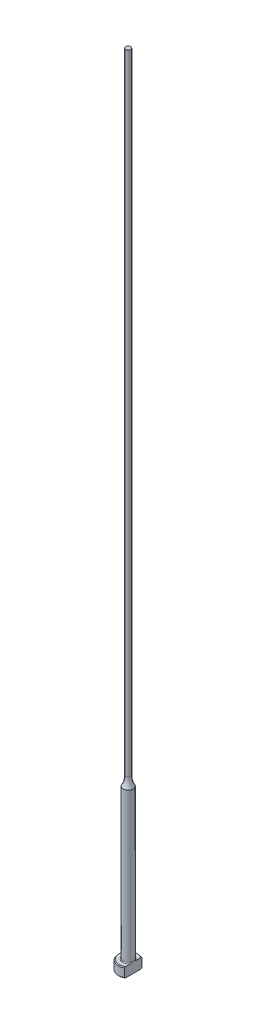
ISO-10303-21;
HEADER;
FILE_DESCRIPTION(('STEP AP214'),'2;1');
FILE_NAME('part.step','',(''),(''),'','','');
FILE_SCHEMA(('AUTOMOTIVE_DESIGN { 1 0 10303 214 1 1 1 1 }'));
ENDSEC;
DATA;
#1=APPLICATION_CONTEXT('core data for automotive mechanical design processes');
#2=APPLICATION_PROTOCOL_DEFINITION('international standard','automotive_design',2000,#1);
#3=PRODUCT_CONTEXT('',#1,'mechanical');
#4=PRODUCT('Part','Part','',(#3));
#5=PRODUCT_RELATED_PRODUCT_CATEGORY('part','',(#4));
#6=PRODUCT_DEFINITION_FORMATION('','',#4);
#7=PRODUCT_DEFINITION_CONTEXT('part definition',#1,'design');
#8=PRODUCT_DEFINITION('design','',#6,#7);
#9=PRODUCT_DEFINITION_SHAPE('','',#8);
#10=(LENGTH_UNIT() NAMED_UNIT(*) SI_UNIT(.MILLI.,.METRE.));
#11=(NAMED_UNIT(*) PLANE_ANGLE_UNIT() SI_UNIT($,.RADIAN.));
#12=(NAMED_UNIT(*) SI_UNIT($,.STERADIAN.) SOLID_ANGLE_UNIT());
#13=UNCERTAINTY_MEASURE_WITH_UNIT(LENGTH_MEASURE(1.E-05),#10,'distance_accuracy_value','');
#14=(GEOMETRIC_REPRESENTATION_CONTEXT(3) GLOBAL_UNCERTAINTY_ASSIGNED_CONTEXT((#13)) GLOBAL_UNIT_ASSIGNED_CONTEXT((#10,
#11,#12)) REPRESENTATION_CONTEXT('',''));
#15=CARTESIAN_POINT('',(0.,0.,0.));
#16=DIRECTION('',(0.,0.,1.));
#17=DIRECTION('',(1.,0.,0.));
#18=AXIS2_PLACEMENT_3D('',#15,#16,#17);
#19=CARTESIAN_POINT('',(-3.17499999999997,3.175,0.));
#20=DIRECTION('',(0.,1.,0.));
#21=DIRECTION('',(0.,0.,1.));
#22=AXIS2_PLACEMENT_3D('',#19,#20,#21);
#23=PLANE('',#22);
#24=CARTESIAN_POINT('',(0.,3.175,0.));
#25=DIRECTION('',(0.,1.,0.));
#26=DIRECTION('',(0.,0.,1.));
#27=AXIS2_PLACEMENT_3D('',#24,#25,#26);
#28=CIRCLE('',#27,2.92099999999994);
#29=CARTESIAN_POINT('',(1.58749999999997,3.175,-2.45195529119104));
#30=VERTEX_POINT('',#29);
#31=CARTESIAN_POINT('',(1.58749999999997,3.175,2.45195529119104));
#32=VERTEX_POINT('',#31);
#33=EDGE_CURVE('E105',#30,#32,#28,.T.);
#34=ORIENTED_EDGE('',*,*,#33,.T.);
#35=DIRECTION('',(0.,0.,1.));
#36=VECTOR('',#35,1.);
#37=CARTESIAN_POINT('',(1.58749999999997,3.17499999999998,2.74963065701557));
#38=LINE('',#37,#36);
#39=CARTESIAN_POINT('',(1.58749999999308,3.175,0.933255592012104));
#40=VERTEX_POINT('',#39);
#41=EDGE_CURVE('E126',#40,#32,#38,.T.);
#42=ORIENTED_EDGE('',*,*,#41,.F.);
#43=CARTESIAN_POINT('',(0.,3.175,0.));
#44=DIRECTION('',(0.,1.,0.));
#45=DIRECTION('',(0.,0.,1.));
#46=AXIS2_PLACEMENT_3D('',#43,#44,#45);
#47=CIRCLE('',#46,1.84149999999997);
#48=CARTESIAN_POINT('',(1.58749999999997,3.17500000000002,-0.933255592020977));
#49=VERTEX_POINT('',#48);
#50=EDGE_CURVE('E11',#40,#49,#47,.F.);
#51=ORIENTED_EDGE('',*,*,#50,.T.);
#52=EDGE_CURVE('E52',#30,#49,#38,.T.);
#53=ORIENTED_EDGE('',*,*,#52,.F.);
#54=EDGE_LOOP('',(#34,#42,#51,#53));
#55=FACE_BOUND('',#54,.T.);
#56=ADVANCED_FACE('F32',(#55),#23,.T.);
#57=CARTESIAN_POINT('',(0.,259.958771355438,0.));
#58=DIRECTION('',(0.,1.,0.));
#59=DIRECTION('',(0.,0.,1.));
#60=AXIS2_PLACEMENT_3D('',#57,#58,#59);
#61=CYLINDRICAL_SURFACE('',#60,3.17499999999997);
#62=CARTESIAN_POINT('',(0.,2.92100000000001,0.));
#63=DIRECTION('',(0.,1.,0.));
#64=DIRECTION('',(0.,0.,1.));
#65=AXIS2_PLACEMENT_3D('',#62,#63,#64);
#66=CIRCLE('',#65,3.17499999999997);
#67=CARTESIAN_POINT('',(1.58749999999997,2.92100000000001,2.74963065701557));
#68=VERTEX_POINT('',#67);
#69=CARTESIAN_POINT('',(1.58749999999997,2.92100000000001,-2.74963065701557));
#70=VERTEX_POINT('',#69);
#71=EDGE_CURVE('E98',#68,#70,#66,.F.);
#72=ORIENTED_EDGE('',*,*,#71,.T.);
#73=DIRECTION('',(0.,-1.,0.));
#74=VECTOR('',#73,1.);
#75=CARTESIAN_POINT('',(1.58749999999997,254.001,-2.74963065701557));
#76=LINE('',#75,#74);
#77=CARTESIAN_POINT('',(1.58749999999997,0.253999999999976,-2.74963065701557));
#78=VERTEX_POINT('',#77);
#79=EDGE_CURVE('E141',#70,#78,#76,.T.);
#80=ORIENTED_EDGE('',*,*,#79,.T.);
#81=CARTESIAN_POINT('',(0.,0.253999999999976,0.));
#82=DIRECTION('',(0.,-1.,0.));
#83=DIRECTION('',(0.,0.,-1.));
#84=AXIS2_PLACEMENT_3D('',#81,#82,#83);
#85=CIRCLE('',#84,3.17499999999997);
#86=CARTESIAN_POINT('',(1.58749999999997,0.253999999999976,2.74963065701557));
#87=VERTEX_POINT('',#86);
#88=EDGE_CURVE('E95',#78,#87,#85,.F.);
#89=ORIENTED_EDGE('',*,*,#88,.T.);
#90=DIRECTION('',(0.,-1.,0.));
#91=VECTOR('',#90,1.);
#92=CARTESIAN_POINT('',(1.58749999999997,254.001,2.74963065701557));
#93=LINE('',#92,#91);
#94=EDGE_CURVE('E88',#68,#87,#93,.T.);
#95=ORIENTED_EDGE('',*,*,#94,.F.);
#96=EDGE_LOOP('',(#72,#80,#89,#95));
#97=FACE_BOUND('',#96,.T.);
#98=ADVANCED_FACE('F191',(#97),#61,.T.);
#99=CARTESIAN_POINT('',(0.,0.,0.));
#100=DIRECTION('',(0.,-1.,0.));
#101=DIRECTION('',(0.,0.,-1.));
#102=AXIS2_PLACEMENT_3D('',#99,#100,#101);
#103=PLANE('',#102);
#104=CARTESIAN_POINT('',(0.,0.,0.));
#105=DIRECTION('',(0.,-1.,0.));
#106=DIRECTION('',(0.,0.,-1.));
#107=AXIS2_PLACEMENT_3D('',#104,#105,#106);
#108=CIRCLE('',#107,2.92100000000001);
#109=CARTESIAN_POINT('',(1.58749999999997,0.,2.45195529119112));
#110=VERTEX_POINT('',#109);
#111=CARTESIAN_POINT('',(1.58749999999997,0.,-2.45195529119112));
#112=VERTEX_POINT('',#111);
#113=EDGE_CURVE('E93',#110,#112,#108,.T.);
#114=ORIENTED_EDGE('',*,*,#113,.T.);
#115=DIRECTION('',(0.,0.,1.));
#116=VECTOR('',#115,1.);
#117=CARTESIAN_POINT('',(1.58749999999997,0.,2.74963065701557));
#118=LINE('',#117,#116);
#119=EDGE_CURVE('E78',#112,#110,#118,.T.);
#120=ORIENTED_EDGE('',*,*,#119,.T.);
#121=EDGE_LOOP('',(#114,#120));
#122=FACE_BOUND('',#121,.T.);
#123=ADVANCED_FACE('F97',(#122),#103,.T.);
#124=CARTESIAN_POINT('',(0.,3.17499999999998,0.));
#125=DIRECTION('',(0.,-1.,0.));
#126=DIRECTION('',(0.,0.,-1.));
#127=AXIS2_PLACEMENT_3D('',#124,#125,#126);
#128=CONICAL_SURFACE('',#127,2.92099999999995,0.785398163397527);
#129=ORIENTED_EDGE('',*,*,#71,.F.);
#130=CARTESIAN_POINT('',(1.58749999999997,-0.16162066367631,-6.0529050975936));
#131=CARTESIAN_POINT('',(1.58749999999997,-0.0288893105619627,-5.91567682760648));
#132=CARTESIAN_POINT('',(1.58749999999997,0.103699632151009,-5.7783103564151));
#133=CARTESIAN_POINT('',(1.58749999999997,0.368508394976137,-5.50321874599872));
#134=CARTESIAN_POINT('',(1.58749999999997,0.500728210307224,-5.36549360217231));
#135=CARTESIAN_POINT('',(1.58749999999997,0.764778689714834,-5.08953516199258));
#136=CARTESIAN_POINT('',(1.58749999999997,0.896609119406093,-4.9513016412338));
#137=CARTESIAN_POINT('',(1.58749999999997,1.15968706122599,-4.67428233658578));
#138=CARTESIAN_POINT('',(1.58749999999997,1.29093457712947,-4.53549655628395));
#139=CARTESIAN_POINT('',(1.58749999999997,1.55007705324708,-4.25997724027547));
#140=CARTESIAN_POINT('',(1.58749999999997,1.67798684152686,-4.12325766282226));
#141=CARTESIAN_POINT('',(1.58749999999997,1.9328486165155,-3.84892898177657));
#142=CARTESIAN_POINT('',(1.58749999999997,2.05980060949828,-3.71131988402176));
#143=CARTESIAN_POINT('',(1.58749999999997,2.31237508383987,-3.43493978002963));
#144=CARTESIAN_POINT('',(1.58749999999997,2.43799784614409,-3.29616903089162));
#145=CARTESIAN_POINT('',(1.58749999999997,2.68741369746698,-3.01699558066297));
#146=CARTESIAN_POINT('',(1.58749999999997,2.81120686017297,-2.8765929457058));
#147=CARTESIAN_POINT('',(1.58749999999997,3.00875865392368,-2.64816703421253));
#148=CARTESIAN_POINT('',(1.58749999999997,3.08336151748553,-2.56087478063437));
#149=CARTESIAN_POINT('',(1.58749999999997,3.2312387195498,-2.38515423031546));
#150=CARTESIAN_POINT('',(1.58749999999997,3.30451292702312,-2.29672582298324));
#151=CARTESIAN_POINT('',(1.58749999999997,3.45004422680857,-2.1174740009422));
#152=CARTESIAN_POINT('',(1.58749999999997,3.5222823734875,-2.02663514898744));
#153=CARTESIAN_POINT('',(1.58749999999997,3.66423097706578,-1.8430252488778));
#154=CARTESIAN_POINT('',(1.58749999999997,3.73394203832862,-1.75025467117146));
#155=CARTESIAN_POINT('',(1.58749999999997,3.87080633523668,-1.5606747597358));
#156=CARTESIAN_POINT('',(1.58749999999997,3.93790459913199,-1.46382547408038));
#157=CARTESIAN_POINT('',(1.58749999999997,4.06669147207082,-1.26632594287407));
#158=CARTESIAN_POINT('',(1.58749999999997,4.1283726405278,-1.16567073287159));
#159=CARTESIAN_POINT('',(1.58749999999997,4.21402252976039,-1.01165766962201));
#160=CARTESIAN_POINT('',(1.58749999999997,4.24127929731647,-0.960142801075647));
#161=CARTESIAN_POINT('',(1.58749999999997,4.2930979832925,-0.855780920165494));
#162=CARTESIAN_POINT('',(1.58749999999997,4.31765941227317,-0.802933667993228));
#163=CARTESIAN_POINT('',(1.58749999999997,4.38614656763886,-0.642461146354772));
#164=CARTESIAN_POINT('',(1.58749999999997,4.42510149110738,-0.532518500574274));
#165=CARTESIAN_POINT('',(1.58749999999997,4.46726244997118,-0.367680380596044));
#166=CARTESIAN_POINT('',(1.58749999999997,4.47844427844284,-0.314802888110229));
#167=CARTESIAN_POINT('',(1.58749999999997,4.49576654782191,-0.208209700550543));
#168=CARTESIAN_POINT('',(1.58749999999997,4.50190743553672,-0.154494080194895));
#169=CARTESIAN_POINT('',(1.58749999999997,4.50871296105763,-0.0468792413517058));
#170=CARTESIAN_POINT('',(1.58749999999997,4.5093945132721,0.00701889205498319));
#171=CARTESIAN_POINT('',(1.58749999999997,4.50527679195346,0.114606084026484));
#172=CARTESIAN_POINT('',(1.58749999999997,4.50047706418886,0.168295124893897));
#173=CARTESIAN_POINT('',(1.58749999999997,4.48579689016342,0.27448544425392));
#174=CARTESIAN_POINT('',(1.58749999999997,4.47596081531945,0.32699298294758));
#175=CARTESIAN_POINT('',(1.58749999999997,4.45181809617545,0.430974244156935));
#176=CARTESIAN_POINT('',(1.58749999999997,4.4375096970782,0.482447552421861));
#177=CARTESIAN_POINT('',(1.58749999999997,4.40502489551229,0.584460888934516));
#178=CARTESIAN_POINT('',(1.58749999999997,4.386827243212,0.634994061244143));
#179=CARTESIAN_POINT('',(1.58749999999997,4.34729308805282,0.734789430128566));
#180=CARTESIAN_POINT('',(1.58749999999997,4.3259572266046,0.784051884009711));
#181=CARTESIAN_POINT('',(1.58749999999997,4.25791922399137,0.930549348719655));
#182=CARTESIAN_POINT('',(1.58749999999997,4.20736047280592,1.0259880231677));
#183=CARTESIAN_POINT('',(1.58749999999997,4.0995545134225,1.21304313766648));
#184=CARTESIAN_POINT('',(1.58749999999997,4.04229912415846,1.30465471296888));
#185=CARTESIAN_POINT('',(1.58749999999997,3.92308746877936,1.48526211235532));
#186=CARTESIAN_POINT('',(1.58749999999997,3.86111349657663,1.57424615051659));
#187=CARTESIAN_POINT('',(1.58749999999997,3.73408621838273,1.74990003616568));
#188=CARTESIAN_POINT('',(1.58749999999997,3.66903444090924,1.83657099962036));
#189=CARTESIAN_POINT('',(1.58749999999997,3.53583371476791,2.00931764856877));
#190=CARTESIAN_POINT('',(1.58749999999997,3.46765527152,2.09537048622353));
#191=CARTESIAN_POINT('',(1.58749999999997,3.32960643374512,2.26611736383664));
#192=CARTESIAN_POINT('',(1.58749999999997,3.25973586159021,2.35081125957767));
#193=CARTESIAN_POINT('',(1.58749999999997,3.04858139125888,2.60290121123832));
#194=CARTESIAN_POINT('',(1.58749999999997,2.90542388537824,2.76872537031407));
#195=CARTESIAN_POINT('',(1.58749999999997,2.64069522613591,3.06970913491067));
#196=CARTESIAN_POINT('',(1.58749999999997,2.51959458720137,3.20528660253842));
#197=CARTESIAN_POINT('',(1.58749999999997,2.27590400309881,3.47510321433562));
#198=CARTESIAN_POINT('',(1.58749999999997,2.15331401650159,3.60934232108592));
#199=CARTESIAN_POINT('',(1.58749999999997,1.90694239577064,3.87695374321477));
#200=CARTESIAN_POINT('',(1.58749999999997,1.78315974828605,4.0103251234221));
#201=CARTESIAN_POINT('',(1.58749999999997,1.53478104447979,4.27630880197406));
#202=CARTESIAN_POINT('',(1.58749999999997,1.41018498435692,4.40892109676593));
#203=CARTESIAN_POINT('',(1.58749999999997,1.0457468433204,4.79499418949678));
#204=CARTESIAN_POINT('',(1.58749999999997,0.80507680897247,5.04767313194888));
#205=CARTESIAN_POINT('',(1.58749999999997,0.443121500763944,5.42550911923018));
#206=CARTESIAN_POINT('',(1.58749999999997,0.322378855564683,5.55118772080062));
#207=CARTESIAN_POINT('',(1.58749999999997,0.0805914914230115,5.80225207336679));
#208=CARTESIAN_POINT('',(1.58749999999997,-0.040453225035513,5.92763782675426));
#209=CARTESIAN_POINT('',(1.58749999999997,-0.161620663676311,6.0529050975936));
#210=B_SPLINE_CURVE_WITH_KNOTS('',3,(#130,#131,#132,#133,#134,#135,#136,#137,#138,#139,#140,
#141,#142,#143,#144,#145,#146,#147,#148,#149,#150,#151,#152,#153,#154,#155,#156,#157,#158,#159,
#160,#161,#162,#163,#164,#165,#166,#167,#168,#169,#170,#171,#172,#173,#174,#175,#176,#177,#178,
#179,#180,#181,#182,#183,#184,#185,#186,#187,#188,#189,#190,#191,#192,#193,#194,#195,#196,#197,
#198,#199,#200,#201,#202,#203,#204,#205,#206,#207,#208,#209),.UNSPECIFIED.,.F.,.F.,(4,2,2,2,2,2,
2,2,2,2,2,2,2,2,2,2,2,2,2,2,2,2,2,2,2,2,2,2,2,2,2,2,2,2,2,2,2,2,2,4),(0.,0.572750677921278,
1.14550874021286,1.71856057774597,2.29160869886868,2.85328006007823,3.4149477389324,
3.97649423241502,4.53801804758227,4.88249307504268,5.22700189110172,5.5751532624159,
5.92322081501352,6.27657800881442,6.63041319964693,6.80518126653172,6.9799810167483,
7.3282426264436,7.49018491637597,7.65211285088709,7.81353889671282,7.97497832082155,
8.13501929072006,8.29512313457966,8.45612518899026,8.61709438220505,8.94062993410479,
9.2645649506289,9.58978187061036,9.91483894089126,10.2441741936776,10.5735441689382,
11.2306812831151,11.7760337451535,12.3214014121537,12.8672825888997,13.4131663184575,
14.4600164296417,14.9828595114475,15.5056983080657),.UNSPECIFIED.);
#211=EDGE_CURVE('E118',#32,#68,#210,.T.);
#212=ORIENTED_EDGE('',*,*,#211,.F.);
#213=ORIENTED_EDGE('',*,*,#33,.F.);
#214=EDGE_CURVE('E117',#70,#30,#210,.T.);
#215=ORIENTED_EDGE('',*,*,#214,.F.);
#216=EDGE_LOOP('',(#129,#212,#213,#215));
#217=FACE_BOUND('',#216,.T.);
#218=ADVANCED_FACE('F162',(#217),#128,.T.);
#219=CARTESIAN_POINT('',(0.,0.253999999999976,0.));
#220=DIRECTION('',(0.,1.,0.));
#221=DIRECTION('',(0.,0.,1.));
#222=AXIS2_PLACEMENT_3D('',#219,#220,#221);
#223=CONICAL_SURFACE('',#222,3.17499999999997,0.785398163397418);
#224=ORIENTED_EDGE('',*,*,#88,.F.);
#225=CARTESIAN_POINT('',(1.58749999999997,3.33662066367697,6.0529050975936));
#226=CARTESIAN_POINT('',(1.58749999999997,3.20388931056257,5.91567682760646));
#227=CARTESIAN_POINT('',(1.58749999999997,3.07130036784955,5.77831035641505));
#228=CARTESIAN_POINT('',(1.58749999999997,2.80649160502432,5.50321874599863));
#229=CARTESIAN_POINT('',(1.58749999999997,2.67427178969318,5.3654936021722));
#230=CARTESIAN_POINT('',(1.58749999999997,2.41022131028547,5.08953516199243));
#231=CARTESIAN_POINT('',(1.58749999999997,2.27839088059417,4.95130164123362));
#232=CARTESIAN_POINT('',(1.58749999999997,2.01531293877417,4.67428233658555));
#233=CARTESIAN_POINT('',(1.58749999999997,1.88406542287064,4.5354965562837));
#234=CARTESIAN_POINT('',(1.58749999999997,1.62492294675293,4.25997724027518));
#235=CARTESIAN_POINT('',(1.58749999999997,1.49701315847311,4.12325766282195));
#236=CARTESIAN_POINT('',(1.58749999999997,1.24215138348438,3.84892898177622));
#237=CARTESIAN_POINT('',(1.58749999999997,1.11519939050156,3.71131988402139));
#238=CARTESIAN_POINT('',(1.58749999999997,0.862624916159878,3.43493978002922));
#239=CARTESIAN_POINT('',(1.58749999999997,0.737002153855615,3.29616903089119));
#240=CARTESIAN_POINT('',(1.58749999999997,0.487586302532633,3.01699558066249));
#241=CARTESIAN_POINT('',(1.58749999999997,0.363793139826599,2.8765929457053));
#242=CARTESIAN_POINT('',(1.58749999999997,0.166241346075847,2.64816703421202));
#243=CARTESIAN_POINT('',(1.58749999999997,0.0916384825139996,2.56087478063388));
#244=CARTESIAN_POINT('',(1.58749999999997,-0.0562387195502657,2.385154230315));
#245=CARTESIAN_POINT('',(1.58749999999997,-0.129512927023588,2.29672582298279));
#246=CARTESIAN_POINT('',(1.58749999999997,-0.27504422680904,2.11747400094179));
#247=CARTESIAN_POINT('',(1.58749999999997,-0.347282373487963,2.02663514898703));
#248=CARTESIAN_POINT('',(1.58749999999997,-0.489230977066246,1.84302524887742));
#249=CARTESIAN_POINT('',(1.58749999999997,-0.558942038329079,1.7502546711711));
#250=CARTESIAN_POINT('',(1.58749999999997,-0.695806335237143,1.56067475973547));
#251=CARTESIAN_POINT('',(1.58749999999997,-0.762904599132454,1.46382547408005));
#252=CARTESIAN_POINT('',(1.58749999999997,-0.891691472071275,1.26632594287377));
#253=CARTESIAN_POINT('',(1.58749999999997,-0.953372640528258,1.16567073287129));
#254=CARTESIAN_POINT('',(1.58749999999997,-1.03902252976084,1.01165766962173));
#255=CARTESIAN_POINT('',(1.58749999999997,-1.06627929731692,0.960142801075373));
#256=CARTESIAN_POINT('',(1.58749999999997,-1.11809798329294,0.85578092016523));
#257=CARTESIAN_POINT('',(1.58749999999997,-1.14265941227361,0.802933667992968));
#258=CARTESIAN_POINT('',(1.58749999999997,-1.21114656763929,0.642461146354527));
#259=CARTESIAN_POINT('',(1.58749999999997,-1.2501014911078,0.532518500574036));
#260=CARTESIAN_POINT('',(1.58749999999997,-1.29226244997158,0.367680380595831));
#261=CARTESIAN_POINT('',(1.58749999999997,-1.30344427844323,0.314802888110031));
#262=CARTESIAN_POINT('',(1.58749999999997,-1.32076654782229,0.208209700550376));
#263=CARTESIAN_POINT('',(1.58749999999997,-1.3269074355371,0.154494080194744));
#264=CARTESIAN_POINT('',(1.58749999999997,-1.333712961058,0.0468792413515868));
#265=CARTESIAN_POINT('',(1.58749999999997,-1.33439451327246,-0.00701889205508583));
#266=CARTESIAN_POINT('',(1.58749999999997,-1.33027679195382,-0.114606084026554));
#267=CARTESIAN_POINT('',(1.58749999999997,-1.32547706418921,-0.168295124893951));
#268=CARTESIAN_POINT('',(1.58749999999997,-1.31079689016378,-0.274485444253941));
#269=CARTESIAN_POINT('',(1.58749999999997,-1.3009608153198,-0.326992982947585));
#270=CARTESIAN_POINT('',(1.58749999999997,-1.27681809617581,-0.430974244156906));
#271=CARTESIAN_POINT('',(1.58749999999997,-1.26250969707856,-0.482447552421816));
#272=CARTESIAN_POINT('',(1.58749999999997,-1.23002489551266,-0.584460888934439));
#273=CARTESIAN_POINT('',(1.58749999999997,-1.21182724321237,-0.634994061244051));
#274=CARTESIAN_POINT('',(1.58749999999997,-1.1722930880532,-0.734789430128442));
#275=CARTESIAN_POINT('',(1.58749999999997,-1.15095722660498,-0.784051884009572));
#276=CARTESIAN_POINT('',(1.58749999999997,-1.08291922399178,-0.93054934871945));
#277=CARTESIAN_POINT('',(1.58749999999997,-1.03236047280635,-1.02598802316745));
#278=CARTESIAN_POINT('',(1.58749999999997,-0.924554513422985,-1.21304313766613));
#279=CARTESIAN_POINT('',(1.58749999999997,-0.86729912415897,-1.30465471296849));
#280=CARTESIAN_POINT('',(1.58749999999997,-0.748087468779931,-1.48526211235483));
#281=CARTESIAN_POINT('',(1.58749999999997,-0.686113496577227,-1.57424615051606));
#282=CARTESIAN_POINT('',(1.58749999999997,-0.55908621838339,-1.74990003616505));
#283=CARTESIAN_POINT('',(1.58749999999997,-0.494034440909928,-1.83657099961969));
#284=CARTESIAN_POINT('',(1.58749999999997,-0.360833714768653,-2.00931764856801));
#285=CARTESIAN_POINT('',(1.58749999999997,-0.292655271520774,-2.09537048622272));
#286=CARTESIAN_POINT('',(1.58749999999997,-0.154606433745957,-2.26611736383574));
#287=CARTESIAN_POINT('',(1.58749999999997,-0.0847358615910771,-2.35081125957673));
#288=CARTESIAN_POINT('',(1.58749999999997,0.126418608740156,-2.60290121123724));
#289=CARTESIAN_POINT('',(1.58749999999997,0.269576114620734,-2.76872537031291));
#290=CARTESIAN_POINT('',(1.58749999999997,0.534304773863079,-3.06970913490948));
#291=CARTESIAN_POINT('',(1.58749999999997,0.655405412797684,-3.20528660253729));
#292=CARTESIAN_POINT('',(1.58749999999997,0.899095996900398,-3.47510321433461));
#293=CARTESIAN_POINT('',(1.58749999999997,1.02168598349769,-3.60934232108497));
#294=CARTESIAN_POINT('',(1.58749999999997,1.26805760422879,-3.87695374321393));
#295=CARTESIAN_POINT('',(1.58749999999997,1.39184025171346,-4.01032512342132));
#296=CARTESIAN_POINT('',(1.58749999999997,1.64021895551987,-4.2763088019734));
#297=CARTESIAN_POINT('',(1.58749999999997,1.76481501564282,-4.40892109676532));
#298=CARTESIAN_POINT('',(1.58749999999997,2.12925315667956,-4.79499418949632));
#299=CARTESIAN_POINT('',(1.58749999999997,2.36992319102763,-5.04767313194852));
#300=CARTESIAN_POINT('',(1.58749999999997,2.73187849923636,-5.42550911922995));
#301=CARTESIAN_POINT('',(1.58749999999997,2.85262114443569,-5.55118772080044));
#302=CARTESIAN_POINT('',(1.58749999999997,3.09440850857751,-5.8022520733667));
#303=CARTESIAN_POINT('',(1.58749999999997,3.2154532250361,-5.92763782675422));
#304=CARTESIAN_POINT('',(1.58749999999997,3.33662066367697,-6.0529050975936));
#305=B_SPLINE_CURVE_WITH_KNOTS('',3,(#225,#226,#227,#228,#229,#230,#231,#232,#233,#234,#235,
#236,#237,#238,#239,#240,#241,#242,#243,#244,#245,#246,#247,#248,#249,#250,#251,#252,#253,#254,
#255,#256,#257,#258,#259,#260,#261,#262,#263,#264,#265,#266,#267,#268,#269,#270,#271,#272,#273,
#274,#275,#276,#277,#278,#279,#280,#281,#282,#283,#284,#285,#286,#287,#288,#289,#290,#291,#292,
#293,#294,#295,#296,#297,#298,#299,#300,#301,#302,#303,#304),.UNSPECIFIED.,.F.,.F.,(4,2,2,2,2,2,
2,2,2,2,2,2,2,2,2,2,2,2,2,2,2,2,2,2,2,2,2,2,2,2,2,2,2,2,2,2,2,2,2,4),(0.,0.57275067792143,
1.14550874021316,1.71856057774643,2.29160869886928,2.85328006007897,3.41494773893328,
3.97649423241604,4.53801804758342,4.88249307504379,5.2270018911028,5.57515326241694,
5.92322081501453,6.27657800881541,6.63041319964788,6.80518126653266,6.97998101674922,
7.32824262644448,7.49018491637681,7.65211285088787,7.81353889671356,7.97497832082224,
8.1350192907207,8.29512313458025,8.45612518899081,8.61709438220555,8.94062993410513,
9.26456495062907,9.58978187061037,9.91483894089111,10.2441741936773,10.5735441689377,
11.2306812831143,11.776033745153,12.3214014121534,12.8672825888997,13.4131663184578,
14.4600164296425,14.9828595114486,15.505698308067),.UNSPECIFIED.);
#306=EDGE_CURVE('E81',#112,#78,#305,.T.);
#307=ORIENTED_EDGE('',*,*,#306,.F.);
#308=ORIENTED_EDGE('',*,*,#113,.F.);
#309=EDGE_CURVE('E84',#87,#110,#305,.T.);
#310=ORIENTED_EDGE('',*,*,#309,.F.);
#311=EDGE_LOOP('',(#224,#307,#308,#310));
#312=FACE_BOUND('',#311,.T.);
#313=ADVANCED_FACE('F92',(#312),#223,.T.);
#314=CARTESIAN_POINT('',(0.,3.42900000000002,0.));
#315=DIRECTION('',(0.,1.,0.));
#316=DIRECTION('',(0.,0.,1.));
#317=AXIS2_PLACEMENT_3D('',#314,#315,#316);
#318=TOROIDAL_SURFACE('',#317,1.84149999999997,0.254);
#319=CARTESIAN_POINT('',(1.58749999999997,3.42900000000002,0.));
#320=CARTESIAN_POINT('',(1.58749999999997,3.42899942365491,-1.9220514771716E-10));
#321=CARTESIAN_POINT('',(1.58749999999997,3.42899884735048,-1.2261161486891E-07));
#322=CARTESIAN_POINT('',(1.58749999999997,3.42899773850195,-5.09676365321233E-07));
#323=CARTESIAN_POINT('',(1.58749999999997,3.42899720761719,-7.78176328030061E-07));
#324=CARTESIAN_POINT('',(1.58749999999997,3.42899614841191,-1.42307272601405E-06));
#325=CARTESIAN_POINT('',(1.58749999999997,3.42899562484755,-1.80713867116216E-06));
#326=CARTESIAN_POINT('',(1.58749999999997,3.42899463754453,-2.63494846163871E-06));
#327=CARTESIAN_POINT('',(1.58749999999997,3.42899417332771,-3.07814756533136E-06));
#328=CARTESIAN_POINT('',(1.58749999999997,3.42899261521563,-4.66897357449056E-06));
#329=CARTESIAN_POINT('',(1.58749999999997,3.42899159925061,-5.89404908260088E-06));
#330=CARTESIAN_POINT('',(1.58749999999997,3.42898979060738,-8.42427511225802E-06));
#331=CARTESIAN_POINT('',(1.58749999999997,3.42898899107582,-9.7248057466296E-06));
#332=CARTESIAN_POINT('',(1.58749999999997,3.42898598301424,-1.48060601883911E-05));
#333=CARTESIAN_POINT('',(1.58749999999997,3.42898393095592,-1.86838281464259E-05));
#334=CARTESIAN_POINT('',(1.58749999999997,3.42898057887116,-2.63261117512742E-05));
#335=CARTESIAN_POINT('',(1.58749999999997,3.42897922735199,-3.00687417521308E-05));
#336=CARTESIAN_POINT('',(1.58749999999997,3.42897347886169,-4.60276298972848E-05));
#337=CARTESIAN_POINT('',(1.58749999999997,3.42896911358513,-5.8247019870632E-05));
#338=CARTESIAN_POINT('',(1.58749999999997,3.42896211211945,-8.11070097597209E-05));
#339=CARTESIAN_POINT('',(1.58749999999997,3.42895931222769,-9.16953114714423E-05));
#340=CARTESIAN_POINT('',(1.58749999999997,3.42893712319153,-0.000168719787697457));
#341=CARTESIAN_POINT('',(1.58749999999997,3.42890881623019,-0.000232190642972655));
#342=CARTESIAN_POINT('',(1.58749999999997,3.42880276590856,-0.000479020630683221));
#343=CARTESIAN_POINT('',(1.58749999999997,3.42873165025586,-0.00066443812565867));
#344=CARTESIAN_POINT('',(1.58749999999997,3.42845137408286,-0.0013844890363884));
#345=CARTESIAN_POINT('',(1.58749999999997,3.42823526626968,-0.00191701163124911));
#346=CARTESIAN_POINT('',(1.58749999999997,3.42735449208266,-0.00409774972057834));
#347=CARTESIAN_POINT('',(1.58749999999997,3.42669768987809,-0.00574830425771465));
#348=CARTESIAN_POINT('',(1.58749999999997,3.4174405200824,-0.0289985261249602));
#349=CARTESIAN_POINT('',(1.58749999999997,3.40878325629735,-0.0505816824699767));
#350=CARTESIAN_POINT('',(1.58749999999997,3.39189297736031,-0.0929947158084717));
#351=CARTESIAN_POINT('',(1.58749999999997,3.38365605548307,-0.11382315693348));
#352=CARTESIAN_POINT('',(1.58749999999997,3.36635393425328,-0.157956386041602));
#353=CARTESIAN_POINT('',(1.58749999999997,3.35730391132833,-0.181267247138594));
#354=CARTESIAN_POINT('',(1.58749999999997,3.33936775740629,-0.228222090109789));
#355=CARTESIAN_POINT('',(1.58749999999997,3.33048420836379,-0.25186705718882));
#356=CARTESIAN_POINT('',(1.58749999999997,3.30894496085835,-0.310512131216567));
#357=CARTESIAN_POINT('',(1.58749999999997,3.29649449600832,-0.345588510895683));
#358=CARTESIAN_POINT('',(1.58749999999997,3.27296975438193,-0.415278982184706));
#359=CARTESIAN_POINT('',(1.58749999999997,3.26186987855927,-0.449884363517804));
#360=CARTESIAN_POINT('',(1.58749999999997,3.2395832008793,-0.524471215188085));
#361=CARTESIAN_POINT('',(1.58749999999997,3.22860862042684,-0.564517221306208));
#362=CARTESIAN_POINT('',(1.58749999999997,3.20902534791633,-0.645529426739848));
#363=CARTESIAN_POINT('',(1.58749999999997,3.20043582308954,-0.686500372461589));
#364=CARTESIAN_POINT('',(1.58749999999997,3.18611712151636,-0.771546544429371));
#365=CARTESIAN_POINT('',(1.58749999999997,3.18059550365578,-0.815658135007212));
#366=CARTESIAN_POINT('',(1.58749999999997,3.17455396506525,-0.904117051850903));
#367=CARTESIAN_POINT('',(1.58749999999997,3.17401361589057,-0.948462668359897));
#368=CARTESIAN_POINT('',(1.58749999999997,3.17898948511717,-1.02531896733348));
#369=CARTESIAN_POINT('',(1.58749999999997,3.1829739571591,-1.05792141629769));
#370=CARTESIAN_POINT('',(1.58749999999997,3.19569167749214,-1.12184393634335));
#371=CARTESIAN_POINT('',(1.58749999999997,3.20436049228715,-1.1531753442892));
#372=CARTESIAN_POINT('',(1.58749999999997,3.22236152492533,-1.19946468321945));
#373=CARTESIAN_POINT('',(1.58749999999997,3.2295150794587,-1.21526783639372));
#374=CARTESIAN_POINT('',(1.58749999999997,3.24587062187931,-1.24583726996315));
#375=CARTESIAN_POINT('',(1.58749999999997,3.25507530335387,-1.26060215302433));
#376=CARTESIAN_POINT('',(1.58749999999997,3.27378481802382,-1.28575815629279));
#377=CARTESIAN_POINT('',(1.58749999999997,3.28289001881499,-1.29644383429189));
#378=CARTESIAN_POINT('',(1.58749999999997,3.30268460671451,-1.31623154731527));
#379=CARTESIAN_POINT('',(1.58749999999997,3.31337067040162,-1.32533681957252));
#380=CARTESIAN_POINT('',(1.58749999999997,3.33349977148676,-1.33941140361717));
#381=CARTESIAN_POINT('',(1.58749999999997,3.34261446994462,-1.34484814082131));
#382=CARTESIAN_POINT('',(1.58749999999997,3.36161455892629,-1.35416329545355));
#383=CARTESIAN_POINT('',(1.58749999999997,3.37149946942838,-1.35804267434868));
#384=CARTESIAN_POINT('',(1.58749999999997,3.39188678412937,-1.36398436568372));
#385=CARTESIAN_POINT('',(1.58749999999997,3.40239309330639,-1.36603350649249));
#386=CARTESIAN_POINT('',(1.58749999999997,3.42360372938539,-1.3680840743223));
#387=CARTESIAN_POINT('',(1.58749999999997,3.43430795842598,-1.36808648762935));
#388=CARTESIAN_POINT('',(1.58749999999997,3.45433283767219,-1.36616208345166));
#389=CARTESIAN_POINT('',(1.58749999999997,3.46367506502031,-1.36444960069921));
#390=CARTESIAN_POINT('',(1.58749999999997,3.48195519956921,-1.35953338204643));
#391=CARTESIAN_POINT('',(1.58749999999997,3.49089304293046,-1.3563294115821));
#392=CARTESIAN_POINT('',(1.58749999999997,3.50850302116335,-1.34848006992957));
#393=CARTESIAN_POINT('',(1.58749999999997,3.5171531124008,-1.34378578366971));
#394=CARTESIAN_POINT('',(1.58749999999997,3.53371257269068,-1.33324445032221));
#395=CARTESIAN_POINT('',(1.58749999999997,3.54162163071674,-1.32739692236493));
#396=CARTESIAN_POINT('',(1.58749999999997,3.56107121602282,-1.31107304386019));
#397=CARTESIAN_POINT('',(1.58749999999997,3.57202221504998,-1.29989286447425));
#398=CARTESIAN_POINT('',(1.58749999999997,3.59202509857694,-1.27593566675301));
#399=CARTESIAN_POINT('',(1.58749999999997,3.60107086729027,-1.26315370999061));
#400=CARTESIAN_POINT('',(1.58749999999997,3.62186023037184,-1.22930733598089));
#401=CARTESIAN_POINT('',(1.58749999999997,3.63240584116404,-1.20751096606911));
#402=CARTESIAN_POINT('',(1.58749999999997,3.65004643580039,-1.16266144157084));
#403=CARTESIAN_POINT('',(1.58749999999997,3.65714435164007,-1.13960937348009));
#404=CARTESIAN_POINT('',(1.58749999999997,3.67265428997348,-1.07603916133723));
#405=CARTESIAN_POINT('',(1.58749999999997,3.67834921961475,-1.03486686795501));
#406=CARTESIAN_POINT('',(1.58749999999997,3.68382880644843,-0.951558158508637));
#407=CARTESIAN_POINT('',(1.58749999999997,3.68350976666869,-0.909417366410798));
#408=CARTESIAN_POINT('',(1.58749999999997,3.67745397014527,-0.811383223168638));
#409=CARTESIAN_POINT('',(1.58749999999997,3.66993873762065,-0.755610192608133));
#410=CARTESIAN_POINT('',(1.58749999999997,3.64933373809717,-0.644937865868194));
#411=CARTESIAN_POINT('',(1.58749999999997,3.63621897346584,-0.59004364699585));
#412=CARTESIAN_POINT('',(1.58749999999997,3.60740922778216,-0.485757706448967));
#413=CARTESIAN_POINT('',(1.58749999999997,3.59201096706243,-0.436281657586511));
#414=CARTESIAN_POINT('',(1.58749999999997,3.55922497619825,-0.338551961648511));
#415=CARTESIAN_POINT('',(1.58749999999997,3.5418584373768,-0.290291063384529));
#416=CARTESIAN_POINT('',(1.58749999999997,3.51760237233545,-0.225557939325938));
#417=CARTESIAN_POINT('',(1.58749999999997,3.51126413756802,-0.208874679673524));
#418=CARTESIAN_POINT('',(1.58749999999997,3.49830042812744,-0.17512392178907));
#419=CARTESIAN_POINT('',(1.58749999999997,3.49167176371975,-0.158057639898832));
#420=CARTESIAN_POINT('',(1.58749999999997,3.47585523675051,-0.117638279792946));
#421=CARTESIAN_POINT('',(1.58749999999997,3.46662970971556,-0.0943002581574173));
#422=CARTESIAN_POINT('',(1.58749999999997,3.44889695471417,-0.0497824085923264));
#423=CARTESIAN_POINT('',(1.58749999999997,3.44040039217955,-0.028598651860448));
#424=CARTESIAN_POINT('',(1.58749999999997,3.43130364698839,-0.00575168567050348));
#425=CARTESIAN_POINT('',(1.58749999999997,3.43064818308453,-0.00410451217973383));
#426=CARTESIAN_POINT('',(1.58749999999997,3.42976776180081,-0.00192459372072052));
#427=CARTESIAN_POINT('',(1.58749999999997,3.42955062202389,-0.00138952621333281));
#428=CARTESIAN_POINT('',(1.58749999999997,3.42926908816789,-0.000666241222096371));
#429=CARTESIAN_POINT('',(1.58749999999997,3.42919771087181,-0.000480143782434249));
#430=CARTESIAN_POINT('',(1.58749999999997,3.42909131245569,-0.000232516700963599));
#431=CARTESIAN_POINT('',(1.58749999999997,3.42906294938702,-0.000168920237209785));
#432=CARTESIAN_POINT('',(1.58749999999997,3.42904072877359,-9.17527162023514E-05));
#433=CARTESIAN_POINT('',(1.58749999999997,3.42903792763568,-8.11550293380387E-05));
#434=CARTESIAN_POINT('',(1.58749999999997,3.42903091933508,-5.82743948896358E-05));
#435=CARTESIAN_POINT('',(1.58749999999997,3.42902654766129,-4.60440001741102E-05));
#436=CARTESIAN_POINT('',(1.58749999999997,3.42902079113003,-3.00727682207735E-05));
#437=CARTESIAN_POINT('',(1.58749999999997,3.42901943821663,-2.63286807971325E-05));
#438=CARTESIAN_POINT('',(1.58749999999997,3.42901608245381,-1.86836529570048E-05));
#439=CARTESIAN_POINT('',(1.58749999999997,3.4290140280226,-1.48046517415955E-05));
#440=CARTESIAN_POINT('',(1.58749999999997,3.42901101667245,-9.72223943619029E-06));
#441=CARTESIAN_POINT('',(1.58749999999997,3.42901021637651,-8.42159649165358E-06));
#442=CARTESIAN_POINT('',(1.58749999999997,3.42900840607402,-5.89129729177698E-06));
#443=CARTESIAN_POINT('',(1.58749999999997,3.42900738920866,-4.66626867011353E-06));
#444=CARTESIAN_POINT('',(1.58749999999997,3.42900582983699,-3.07568803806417E-06));
#445=CARTESIAN_POINT('',(1.58749999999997,3.42900536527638,-2.63259565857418E-06));
#446=CARTESIAN_POINT('',(1.58749999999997,3.4290043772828,-1.80506085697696E-06));
#447=CARTESIAN_POINT('',(1.58749999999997,3.42900385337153,-1.42116387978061E-06));
#448=CARTESIAN_POINT('',(1.58749999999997,3.42900279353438,-7.76675643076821E-07));
#449=CARTESIAN_POINT('',(1.58749999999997,3.42900226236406,-5.08406487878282E-07));
#450=CARTESIAN_POINT('',(1.58749999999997,3.42900115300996,-1.21901887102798E-07));
#451=CARTESIAN_POINT('',(1.58749999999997,3.42900057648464,1.92251677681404E-10));
#452=CARTESIAN_POINT('',(1.58749999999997,3.42900000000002,0.));
#453=B_SPLINE_CURVE_WITH_KNOTS('',3,(#319,#320,#321,#322,#323,#324,#325,#326,#327,#328,#329,
#330,#331,#332,#333,#334,#335,#336,#337,#338,#339,#340,#341,#342,#343,#344,#345,#346,#347,#348,
#349,#350,#351,#352,#353,#354,#355,#356,#357,#358,#359,#360,#361,#362,#363,#364,#365,#366,#367,
#368,#369,#370,#371,#372,#373,#374,#375,#376,#377,#378,#379,#380,#381,#382,#383,#384,#385,#386,
#387,#388,#389,#390,#391,#392,#393,#394,#395,#396,#397,#398,#399,#400,#401,#402,#403,#404,#405,
#406,#407,#408,#409,#410,#411,#412,#413,#414,#415,#416,#417,#418,#419,#420,#421,#422,#423,#424,
#425,#426,#427,#428,#429,#430,#431,#432,#433,#434,#435,#436,#437,#438,#439,#440,#441,#442,#443,
#444,#445,#446,#447,#448,#449,#450,#451,#452),.UNSPECIFIED.,.T.,.F.,(4,2,2,2,2,2,2,2,2,2,2,2,2,
2,2,2,2,2,2,2,2,2,2,2,2,2,2,2,2,2,2,2,2,2,2,2,2,2,2,2,2,2,2,2,2,2,2,2,2,2,2,2,2,2,2,2,2,2,2,2,2,
2,2,2,2,2,4),(0.,1.72815458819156E-06,3.50429255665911E-06,5.44431004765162E-06,
7.3675525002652E-06,1.2119089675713E-05,1.66953775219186E-05,2.98160400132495E-05,
4.17409564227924E-05,8.0660475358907E-05,0.000113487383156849,0.000321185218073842,
0.000917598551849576,0.00264089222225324,0.00797105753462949,0.0777276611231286,
0.144923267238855,0.219939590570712,0.295714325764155,0.407362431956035,0.516367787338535,
0.640878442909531,0.766362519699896,0.899536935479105,1.03216495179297,1.13045740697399,
1.22743103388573,1.27935899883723,1.33135556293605,1.37333248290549,1.41522237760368,
1.44693946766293,1.47863694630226,1.51056074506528,1.54246916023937,1.57083210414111,
1.59919951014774,1.62861579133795,1.65804436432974,1.70472658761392,1.75155645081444,
1.82378709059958,1.89595619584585,2.01995471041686,2.1460932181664,2.31447224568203,
2.48361094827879,2.6389891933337,2.79283011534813,2.84637031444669,2.9012946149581,
2.97658236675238,3.04504771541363,3.05036697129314,3.05209849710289,3.05269709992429,
3.05290520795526,3.05293806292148,3.05297701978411,3.05298895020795,3.05300207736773,
3.05300665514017,3.0530114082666,3.05301333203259,3.05301527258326,3.05301704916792,
3.05301877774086),.UNSPECIFIED.);
#454=CARTESIAN_POINT('',(1.58749999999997,3.42900000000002,0.));
#455=VERTEX_POINT('',#454);
#456=EDGE_CURVE('E47',#455,#49,#453,.T.);
#457=ORIENTED_EDGE('',*,*,#456,.T.);
#458=ORIENTED_EDGE('',*,*,#50,.F.);
#459=CARTESIAN_POINT('',(1.58749999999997,3.42900000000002,0.));
#460=CARTESIAN_POINT('',(1.58749999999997,3.42900057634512,1.9220512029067E-10));
#461=CARTESIAN_POINT('',(1.58749999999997,3.42900115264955,1.22611614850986E-07));
#462=CARTESIAN_POINT('',(1.58749999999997,3.42900226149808,5.09676365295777E-07));
#463=CARTESIAN_POINT('',(1.58749999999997,3.42900279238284,7.78176328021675E-07));
#464=CARTESIAN_POINT('',(1.58749999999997,3.42900385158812,1.42307272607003E-06));
#465=CARTESIAN_POINT('',(1.58749999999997,3.42900437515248,1.80713867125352E-06));
#466=CARTESIAN_POINT('',(1.58749999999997,3.4290053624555,2.63494846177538E-06));
#467=CARTESIAN_POINT('',(1.58749999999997,3.42900582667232,3.0781475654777E-06));
#468=CARTESIAN_POINT('',(1.58749999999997,3.4290073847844,4.66897357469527E-06));
#469=CARTESIAN_POINT('',(1.58749999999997,3.42900840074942,5.89404908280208E-06));
#470=CARTESIAN_POINT('',(1.58749999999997,3.42901020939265,8.42427511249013E-06));
#471=CARTESIAN_POINT('',(1.58749999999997,3.42901100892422,9.72480574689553E-06));
#472=CARTESIAN_POINT('',(1.58749999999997,3.42901401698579,1.48060601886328E-05));
#473=CARTESIAN_POINT('',(1.58749999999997,3.42901606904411,1.86838281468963E-05));
#474=CARTESIAN_POINT('',(1.58749999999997,3.42901942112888,2.63261117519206E-05));
#475=CARTESIAN_POINT('',(1.58749999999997,3.42902077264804,3.00687417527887E-05));
#476=CARTESIAN_POINT('',(1.58749999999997,3.42902652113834,4.60276298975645E-05));
#477=CARTESIAN_POINT('',(1.58749999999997,3.4290308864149,5.82470198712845E-05));
#478=CARTESIAN_POINT('',(1.58749999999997,3.42903788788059,8.11070097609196E-05));
#479=CARTESIAN_POINT('',(1.58749999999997,3.42904068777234,9.16953114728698E-05));
#480=CARTESIAN_POINT('',(1.58749999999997,3.4290628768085,0.000168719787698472));
#481=CARTESIAN_POINT('',(1.58749999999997,3.42909118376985,0.000232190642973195));
#482=CARTESIAN_POINT('',(1.58749999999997,3.42919723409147,0.000479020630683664));
#483=CARTESIAN_POINT('',(1.58749999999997,3.42926834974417,0.000664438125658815));
#484=CARTESIAN_POINT('',(1.58749999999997,3.42954862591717,0.00138448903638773));
#485=CARTESIAN_POINT('',(1.58749999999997,3.42976473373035,0.00191701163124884));
#486=CARTESIAN_POINT('',(1.58749999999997,3.43064550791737,0.00409774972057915));
#487=CARTESIAN_POINT('',(1.58749999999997,3.43130231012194,0.00574830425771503));
#488=CARTESIAN_POINT('',(1.58749999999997,3.44055947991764,0.0289985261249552));
#489=CARTESIAN_POINT('',(1.58749999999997,3.44921674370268,0.0505816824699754));
#490=CARTESIAN_POINT('',(1.58749999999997,3.46610702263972,0.0929947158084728));
#491=CARTESIAN_POINT('',(1.58749999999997,3.47434394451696,0.11382315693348));
#492=CARTESIAN_POINT('',(1.58749999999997,3.49164606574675,0.157956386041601));
#493=CARTESIAN_POINT('',(1.58749999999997,3.5006960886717,0.181267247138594));
#494=CARTESIAN_POINT('',(1.58749999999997,3.51863224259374,0.228222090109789));
#495=CARTESIAN_POINT('',(1.58749999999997,3.52751579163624,0.25186705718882));
#496=CARTESIAN_POINT('',(1.58749999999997,3.54905503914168,0.310512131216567));
#497=CARTESIAN_POINT('',(1.58749999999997,3.56150550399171,0.345588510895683));
#498=CARTESIAN_POINT('',(1.58749999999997,3.5850302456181,0.415278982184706));
#499=CARTESIAN_POINT('',(1.58749999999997,3.59613012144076,0.449884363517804));
#500=CARTESIAN_POINT('',(1.58749999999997,3.61841679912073,0.524471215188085));
#501=CARTESIAN_POINT('',(1.58749999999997,3.62939137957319,0.564517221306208));
#502=CARTESIAN_POINT('',(1.58749999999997,3.6489746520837,0.645529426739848));
#503=CARTESIAN_POINT('',(1.58749999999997,3.65756417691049,0.686500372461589));
#504=CARTESIAN_POINT('',(1.58749999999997,3.67188287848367,0.771546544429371));
#505=CARTESIAN_POINT('',(1.58749999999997,3.67740449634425,0.815658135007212));
#506=CARTESIAN_POINT('',(1.58749999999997,3.68344603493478,0.904117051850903));
#507=CARTESIAN_POINT('',(1.58749999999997,3.68398638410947,0.948462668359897));
#508=CARTESIAN_POINT('',(1.58749999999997,3.67901051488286,1.02531896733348));
#509=CARTESIAN_POINT('',(1.58749999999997,3.67502604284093,1.05792141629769));
#510=CARTESIAN_POINT('',(1.58749999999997,3.66230832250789,1.12184393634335));
#511=CARTESIAN_POINT('',(1.58749999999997,3.65363950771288,1.1531753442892));
#512=CARTESIAN_POINT('',(1.58749999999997,3.6356384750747,1.19946468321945));
#513=CARTESIAN_POINT('',(1.58749999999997,3.62848492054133,1.21526783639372));
#514=CARTESIAN_POINT('',(1.58749999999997,3.61212937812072,1.24583726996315));
#515=CARTESIAN_POINT('',(1.58749999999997,3.60292469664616,1.26060215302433));
#516=CARTESIAN_POINT('',(1.58749999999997,3.58421518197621,1.28575815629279));
#517=CARTESIAN_POINT('',(1.58749999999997,3.57510998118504,1.29644383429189));
#518=CARTESIAN_POINT('',(1.58749999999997,3.55531539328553,1.31623154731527));
#519=CARTESIAN_POINT('',(1.58749999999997,3.54462932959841,1.32533681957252));
#520=CARTESIAN_POINT('',(1.58749999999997,3.52450022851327,1.33941140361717));
#521=CARTESIAN_POINT('',(1.58749999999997,3.51538553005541,1.34484814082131));
#522=CARTESIAN_POINT('',(1.58749999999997,3.49638544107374,1.35416329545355));
#523=CARTESIAN_POINT('',(1.58749999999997,3.48650053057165,1.35804267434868));
#524=CARTESIAN_POINT('',(1.58749999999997,3.46611321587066,1.36398436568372));
#525=CARTESIAN_POINT('',(1.58749999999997,3.45560690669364,1.36603350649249));
#526=CARTESIAN_POINT('',(1.58749999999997,3.43439627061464,1.3680840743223));
#527=CARTESIAN_POINT('',(1.58749999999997,3.42369204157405,1.36808648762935));
#528=CARTESIAN_POINT('',(1.58749999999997,3.40366716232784,1.36616208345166));
#529=CARTESIAN_POINT('',(1.58749999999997,3.39432493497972,1.36444960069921));
#530=CARTESIAN_POINT('',(1.58749999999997,3.37604480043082,1.35953338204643));
#531=CARTESIAN_POINT('',(1.58749999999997,3.36710695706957,1.3563294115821));
#532=CARTESIAN_POINT('',(1.58749999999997,3.34949697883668,1.34848006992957));
#533=CARTESIAN_POINT('',(1.58749999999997,3.34084688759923,1.34378578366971));
#534=CARTESIAN_POINT('',(1.58749999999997,3.32428742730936,1.33324445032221));
#535=CARTESIAN_POINT('',(1.58749999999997,3.31637836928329,1.32739692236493));
#536=CARTESIAN_POINT('',(1.58749999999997,3.29692878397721,1.31107304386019));
#537=CARTESIAN_POINT('',(1.58749999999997,3.28597778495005,1.29989286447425));
#538=CARTESIAN_POINT('',(1.58749999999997,3.26597490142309,1.27593566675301));
#539=CARTESIAN_POINT('',(1.58749999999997,3.25692913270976,1.26315370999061));
#540=CARTESIAN_POINT('',(1.58749999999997,3.23613976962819,1.22930733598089));
#541=CARTESIAN_POINT('',(1.58749999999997,3.22559415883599,1.20751096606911));
#542=CARTESIAN_POINT('',(1.58749999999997,3.20795356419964,1.16266144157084));
#543=CARTESIAN_POINT('',(1.58749999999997,3.20085564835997,1.13960937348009));
#544=CARTESIAN_POINT('',(1.58749999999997,3.18534571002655,1.07603916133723));
#545=CARTESIAN_POINT('',(1.58749999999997,3.17965078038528,1.03486686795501));
#546=CARTESIAN_POINT('',(1.58749999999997,3.1741711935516,0.951558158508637));
#547=CARTESIAN_POINT('',(1.58749999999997,3.17449023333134,0.909417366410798));
#548=CARTESIAN_POINT('',(1.58749999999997,3.18054602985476,0.811383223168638));
#549=CARTESIAN_POINT('',(1.58749999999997,3.18806126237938,0.755610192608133));
#550=CARTESIAN_POINT('',(1.58749999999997,3.20866626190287,0.644937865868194));
#551=CARTESIAN_POINT('',(1.58749999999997,3.2217810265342,0.59004364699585));
#552=CARTESIAN_POINT('',(1.58749999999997,3.25059077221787,0.485757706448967));
#553=CARTESIAN_POINT('',(1.58749999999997,3.2659890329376,0.43628165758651));
#554=CARTESIAN_POINT('',(1.58749999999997,3.29877502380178,0.338551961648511));
#555=CARTESIAN_POINT('',(1.58749999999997,3.31614156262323,0.290291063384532));
#556=CARTESIAN_POINT('',(1.58749999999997,3.34039762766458,0.225557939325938));
#557=CARTESIAN_POINT('',(1.58749999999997,3.346735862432,0.208874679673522));
#558=CARTESIAN_POINT('',(1.58749999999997,3.35969957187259,0.175123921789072));
#559=CARTESIAN_POINT('',(1.58749999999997,3.3663282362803,0.15805763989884));
#560=CARTESIAN_POINT('',(1.58749999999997,3.3821447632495,0.117638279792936));
#561=CARTESIAN_POINT('',(1.58749999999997,3.39137029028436,0.0943002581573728));
#562=CARTESIAN_POINT('',(1.58749999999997,3.40910304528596,0.0497824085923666));
#563=CARTESIAN_POINT('',(1.58749999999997,3.41759960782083,0.0285986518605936));
#564=CARTESIAN_POINT('',(1.58749999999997,3.42669635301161,0.00575168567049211));
#565=CARTESIAN_POINT('',(1.58749999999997,3.42735181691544,0.00410451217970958));
#566=CARTESIAN_POINT('',(1.58749999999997,3.42823223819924,0.00192459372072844));
#567=CARTESIAN_POINT('',(1.58749999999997,3.42844937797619,0.00138952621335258));
#568=CARTESIAN_POINT('',(1.58749999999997,3.42873091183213,0.000666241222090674));
#569=CARTESIAN_POINT('',(1.58749999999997,3.42880228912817,0.000480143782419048));
#570=CARTESIAN_POINT('',(1.58749999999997,3.42890868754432,0.000232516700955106));
#571=CARTESIAN_POINT('',(1.58749999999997,3.42893705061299,0.000168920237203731));
#572=CARTESIAN_POINT('',(1.58749999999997,3.42895927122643,9.17527161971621E-05));
#573=CARTESIAN_POINT('',(1.58749999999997,3.42896207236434,8.1155029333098E-05));
#574=CARTESIAN_POINT('',(1.58749999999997,3.42896908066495,5.82743948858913E-05));
#575=CARTESIAN_POINT('',(1.58749999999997,3.42897345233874,4.60440001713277E-05));
#576=CARTESIAN_POINT('',(1.58749999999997,3.42897920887,3.00727682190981E-05));
#577=CARTESIAN_POINT('',(1.58749999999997,3.42898056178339,2.63286807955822E-05));
#578=CARTESIAN_POINT('',(1.58749999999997,3.42898391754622,1.86836529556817E-05));
#579=CARTESIAN_POINT('',(1.58749999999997,3.42898597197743,1.48046517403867E-05));
#580=CARTESIAN_POINT('',(1.58749999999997,3.42898898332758,9.72223943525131E-06));
#581=CARTESIAN_POINT('',(1.58749999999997,3.42898978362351,8.42159649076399E-06));
#582=CARTESIAN_POINT('',(1.58749999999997,3.42899159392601,5.89129729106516E-06));
#583=CARTESIAN_POINT('',(1.58749999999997,3.42899261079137,4.66626866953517E-06));
#584=CARTESIAN_POINT('',(1.58749999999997,3.42899417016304,3.0756880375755E-06));
#585=CARTESIAN_POINT('',(1.58749999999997,3.42899463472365,2.63259565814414E-06));
#586=CARTESIAN_POINT('',(1.58749999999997,3.42899562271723,1.80506085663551E-06));
#587=CARTESIAN_POINT('',(1.58749999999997,3.42899614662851,1.42116387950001E-06));
#588=CARTESIAN_POINT('',(1.58749999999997,3.42899720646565,7.7667564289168E-07));
#589=CARTESIAN_POINT('',(1.58749999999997,3.42899773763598,5.0840648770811E-07));
#590=CARTESIAN_POINT('',(1.58749999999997,3.42899884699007,1.21901887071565E-07));
#591=CARTESIAN_POINT('',(1.58749999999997,3.42899942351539,-1.92251650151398E-10));
#592=CARTESIAN_POINT('',(1.58749999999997,3.42900000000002,0.));
#593=B_SPLINE_CURVE_WITH_KNOTS('',3,(#459,#460,#461,#462,#463,#464,#465,#466,#467,#468,#469,
#470,#471,#472,#473,#474,#475,#476,#477,#478,#479,#480,#481,#482,#483,#484,#485,#486,#487,#488,
#489,#490,#491,#492,#493,#494,#495,#496,#497,#498,#499,#500,#501,#502,#503,#504,#505,#506,#507,
#508,#509,#510,#511,#512,#513,#514,#515,#516,#517,#518,#519,#520,#521,#522,#523,#524,#525,#526,
#527,#528,#529,#530,#531,#532,#533,#534,#535,#536,#537,#538,#539,#540,#541,#542,#543,#544,#545,
#546,#547,#548,#549,#550,#551,#552,#553,#554,#555,#556,#557,#558,#559,#560,#561,#562,#563,#564,
#565,#566,#567,#568,#569,#570,#571,#572,#573,#574,#575,#576,#577,#578,#579,#580,#581,#582,#583,
#584,#585,#586,#587,#588,#589,#590,#591,#592),.UNSPECIFIED.,.T.,.F.,(4,2,2,2,2,2,2,2,2,2,2,2,2,
2,2,2,2,2,2,2,2,2,2,2,2,2,2,2,2,2,2,2,2,2,2,2,2,2,2,2,2,2,2,2,2,2,2,2,2,2,2,2,2,2,2,2,2,2,2,2,2,
2,2,2,2,2,4),(0.,1.72815458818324E-06,3.50429255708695E-06,5.44431004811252E-06,
7.36755250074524E-06,1.21190896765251E-05,1.66953775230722E-05,2.98160400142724E-05,
4.17409564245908E-05,8.06604753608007E-05,0.000113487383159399,0.000321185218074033,
0.000917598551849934,0.00264089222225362,0.00797105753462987,0.077727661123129,
0.144923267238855,0.219939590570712,0.295714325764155,0.407362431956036,0.516367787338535,
0.640878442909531,0.766362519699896,0.899536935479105,1.03216495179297,1.13045740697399,
1.22743103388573,1.27935899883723,1.33135556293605,1.37333248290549,1.41522237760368,
1.44693946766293,1.47863694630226,1.51056074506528,1.54246916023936,1.57083210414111,
1.59919951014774,1.62861579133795,1.65804436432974,1.70472658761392,1.75155645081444,
1.82378709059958,1.89595619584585,2.01995471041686,2.1460932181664,2.31447224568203,
2.48361094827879,2.6389891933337,2.79283011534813,2.84637031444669,2.9012946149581,
2.97658236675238,3.04504771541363,3.05036697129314,3.05209849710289,3.05269709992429,
3.05290520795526,3.05293806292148,3.05297701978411,3.05298895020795,3.05300207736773,
3.05300665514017,3.0530114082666,3.05301333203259,3.05301527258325,3.05301704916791,
3.05301877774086),.UNSPECIFIED.);
#594=EDGE_CURVE('E147',#40,#455,#593,.T.);
#595=ORIENTED_EDGE('',*,*,#594,.T.);
#596=CARTESIAN_POINT('',(0.,3.42900000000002,0.));
#597=DIRECTION('',(0.,1.,0.));
#598=DIRECTION('',(0.,0.,1.));
#599=AXIS2_PLACEMENT_3D('',#596,#597,#598);
#600=CIRCLE('',#599,1.58749999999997);
#601=EDGE_CURVE('E40',#455,#455,#600,.T.);
#602=ORIENTED_EDGE('',*,*,#601,.F.);
#603=EDGE_LOOP('',(#457,#458,#595,#602));
#604=FACE_BOUND('',#603,.T.);
#605=ADVANCED_FACE('F34',(#604),#318,.F.);
#606=CARTESIAN_POINT('',(-0.79374999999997,254.,0.));
#607=DIRECTION('',(0.,1.,0.));
#608=DIRECTION('',(0.,0.,1.));
#609=AXIS2_PLACEMENT_3D('',#606,#607,#608);
#610=PLANE('',#609);
#611=CARTESIAN_POINT('',(0.,254.,0.));
#612=DIRECTION('',(0.,1.,0.));
#613=DIRECTION('',(0.,0.,1.));
#614=AXIS2_PLACEMENT_3D('',#611,#612,#613);
#615=CIRCLE('',#614,0.79374999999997);
#616=CARTESIAN_POINT('',(0.,254.,0.79374999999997));
#617=VERTEX_POINT('',#616);
#618=EDGE_CURVE('E108',#617,#617,#615,.T.);
#619=ORIENTED_EDGE('',*,*,#618,.T.);
#620=EDGE_LOOP('',(#619));
#621=FACE_BOUND('',#620,.T.);
#622=ADVANCED_FACE('F180',(#621),#610,.T.);
#623=CARTESIAN_POINT('',(0.,259.958771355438,0.));
#624=DIRECTION('',(0.,1.,0.));
#625=DIRECTION('',(0.,0.,1.));
#626=AXIS2_PLACEMENT_3D('',#623,#624,#625);
#627=CYLINDRICAL_SURFACE('',#626,0.79374999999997);
#628=CARTESIAN_POINT('',(0.,53.8741805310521,0.));
#629=DIRECTION('',(0.,1.,0.));
#630=DIRECTION('',(0.,0.,1.));
#631=AXIS2_PLACEMENT_3D('',#628,#629,#630);
#632=CIRCLE('',#631,0.79374999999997);
#633=CARTESIAN_POINT('',(0.,53.8741805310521,0.79374999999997));
#634=VERTEX_POINT('',#633);
#635=EDGE_CURVE('E111',#634,#634,#632,.T.);
#636=ORIENTED_EDGE('',*,*,#635,.T.);
#637=EDGE_LOOP('',(#636));
#638=FACE_BOUND('',#637,.T.);
#639=ORIENTED_EDGE('',*,*,#618,.F.);
#640=EDGE_LOOP('',(#639));
#641=FACE_BOUND('',#640,.T.);
#642=ADVANCED_FACE('F174',(#638,#641),#627,.T.);
#643=CARTESIAN_POINT('',(0.,53.8741805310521,0.));
#644=DIRECTION('',(0.,1.,0.));
#645=DIRECTION('',(0.,0.,1.));
#646=AXIS2_PLACEMENT_3D('',#643,#644,#645);
#647=TOROIDAL_SURFACE('',#646,7.14374999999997,6.35);
#648=CARTESIAN_POINT('',(0.,50.8,0.));
#649=DIRECTION('',(0.,1.,0.));
#650=DIRECTION('',(0.,0.,1.));
#651=AXIS2_PLACEMENT_3D('',#648,#649,#650);
#652=CIRCLE('',#651,1.58749999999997);
#653=CARTESIAN_POINT('',(0.,50.8,1.58749999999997));
#654=VERTEX_POINT('',#653);
#655=EDGE_CURVE('E114',#654,#654,#652,.T.);
#656=ORIENTED_EDGE('',*,*,#655,.T.);
#657=EDGE_LOOP('',(#656));
#658=FACE_BOUND('',#657,.T.);
#659=ORIENTED_EDGE('',*,*,#635,.F.);
#660=EDGE_LOOP('',(#659));
#661=FACE_BOUND('',#660,.T.);
#662=ADVANCED_FACE('F168',(#658,#661),#647,.F.);
#663=CARTESIAN_POINT('',(0.,259.958771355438,0.));
#664=DIRECTION('',(0.,1.,0.));
#665=DIRECTION('',(0.,0.,1.));
#666=AXIS2_PLACEMENT_3D('',#663,#664,#665);
#667=CYLINDRICAL_SURFACE('',#666,1.58749999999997);
#668=ORIENTED_EDGE('',*,*,#601,.T.);
#669=EDGE_LOOP('',(#668));
#670=FACE_BOUND('',#669,.T.);
#671=ORIENTED_EDGE('',*,*,#655,.F.);
#672=EDGE_LOOP('',(#671));
#673=FACE_BOUND('',#672,.T.);
#674=ADVANCED_FACE('F165',(#670,#673),#667,.T.);
#675=CARTESIAN_POINT('',(1.58749999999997,254.001,2.74963065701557));
#676=DIRECTION('',(1.,0.,0.));
#677=DIRECTION('',(0.,0.,-1.));
#678=AXIS2_PLACEMENT_3D('',#675,#676,#677);
#679=PLANE('',#678);
#680=ORIENTED_EDGE('',*,*,#309,.T.);
#681=ORIENTED_EDGE('',*,*,#119,.F.);
#682=ORIENTED_EDGE('',*,*,#306,.T.);
#683=ORIENTED_EDGE('',*,*,#79,.F.);
#684=ORIENTED_EDGE('',*,*,#214,.T.);
#685=ORIENTED_EDGE('',*,*,#52,.T.);
#686=ORIENTED_EDGE('',*,*,#456,.F.);
#687=ORIENTED_EDGE('',*,*,#594,.F.);
#688=ORIENTED_EDGE('',*,*,#41,.T.);
#689=ORIENTED_EDGE('',*,*,#211,.T.);
#690=ORIENTED_EDGE('',*,*,#94,.T.);
#691=EDGE_LOOP('',(#680,#681,#682,#683,#684,#685,#686,#687,#688,#689,#690));
#692=FACE_BOUND('',#691,.T.);
#693=ADVANCED_FACE('F80',(#692),#679,.T.);
#694=CLOSED_SHELL('',(#56,#98,#123,#218,#313,#605,#622,#642,#662,#674,#693));
#695=MANIFOLD_SOLID_BREP('B2',#694);
#696=ADVANCED_BREP_SHAPE_REPRESENTATION('',(#18,#695),#14);
#697=SHAPE_DEFINITION_REPRESENTATION(#9,#696);
ENDSEC;
END-ISO-10303-21;
